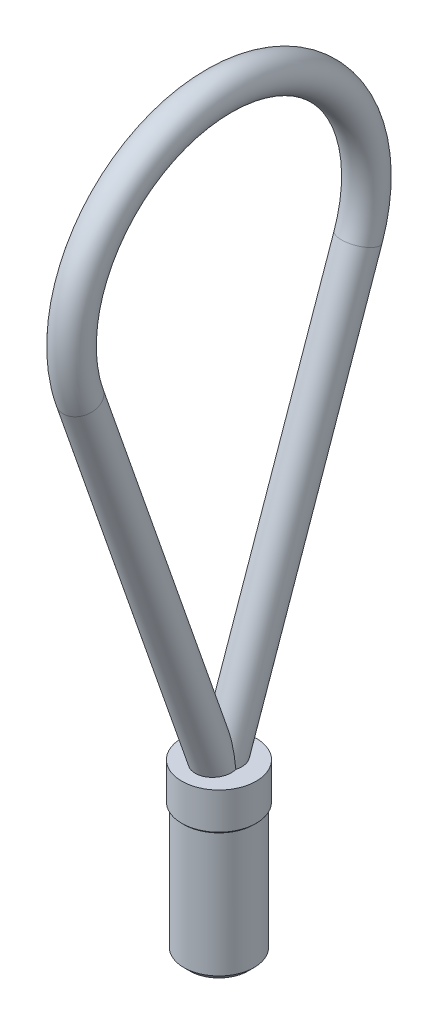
ISO-10303-21;
HEADER;
FILE_DESCRIPTION(('STEP AP214'),'2;1');
FILE_NAME('part.step','',(''),(''),'','','');
FILE_SCHEMA(('AUTOMOTIVE_DESIGN { 1 0 10303 214 1 1 1 1 }'));
ENDSEC;
DATA;
#1=APPLICATION_CONTEXT('core data for automotive mechanical design processes');
#2=APPLICATION_PROTOCOL_DEFINITION('international standard','automotive_design',2000,#1);
#3=PRODUCT_CONTEXT('',#1,'mechanical');
#4=PRODUCT('Part','Part','',(#3));
#5=PRODUCT_RELATED_PRODUCT_CATEGORY('part','',(#4));
#6=PRODUCT_DEFINITION_FORMATION('','',#4);
#7=PRODUCT_DEFINITION_CONTEXT('part definition',#1,'design');
#8=PRODUCT_DEFINITION('design','',#6,#7);
#9=PRODUCT_DEFINITION_SHAPE('','',#8);
#10=(LENGTH_UNIT() NAMED_UNIT(*) SI_UNIT(.MILLI.,.METRE.));
#11=(NAMED_UNIT(*) PLANE_ANGLE_UNIT() SI_UNIT($,.RADIAN.));
#12=(NAMED_UNIT(*) SI_UNIT($,.STERADIAN.) SOLID_ANGLE_UNIT());
#13=UNCERTAINTY_MEASURE_WITH_UNIT(LENGTH_MEASURE(1.E-05),#10,'distance_accuracy_value','');
#14=(GEOMETRIC_REPRESENTATION_CONTEXT(3) GLOBAL_UNCERTAINTY_ASSIGNED_CONTEXT((#13)) GLOBAL_UNIT_ASSIGNED_CONTEXT((#10,
#11,#12)) REPRESENTATION_CONTEXT('',''));
#15=CARTESIAN_POINT('',(0.,0.,0.));
#16=DIRECTION('',(0.,0.,1.));
#17=DIRECTION('',(1.,0.,0.));
#18=AXIS2_PLACEMENT_3D('',#15,#16,#17);
#19=CARTESIAN_POINT('',(0.,207.60000031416,17.9999963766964));
#20=DIRECTION('',(0.,1.,-1.74532925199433E-08));
#21=DIRECTION('',(0.,1.74532925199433E-08,1.));
#22=AXIS2_PLACEMENT_3D('',#19,#20,#21);
#23=PLANE('',#22);
#24=CARTESIAN_POINT('',(0.,207.60000031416,17.9999963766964));
#25=DIRECTION('',(0.,1.,-1.74532925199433E-08));
#26=DIRECTION('',(0.,1.74532925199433E-08,1.));
#27=AXIS2_PLACEMENT_3D('',#24,#25,#26);
#28=CIRCLE('',#27,8.48);
#29=CARTESIAN_POINT('',(0.,207.600000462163,26.4799963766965));
#30=VERTEX_POINT('',#29);
#31=EDGE_CURVE('E11',#30,#30,#28,.T.);
#32=ORIENTED_EDGE('',*,*,#31,.T.);
#33=EDGE_LOOP('',(#32));
#34=FACE_BOUND('',#33,.T.);
#35=CARTESIAN_POINT('',(0.,207.600000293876,16.8378663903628));
#36=DIRECTION('',(0.,1.,-1.74532925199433E-08));
#37=DIRECTION('',(0.,-1.74532925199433E-08,-1.));
#38=AXIS2_PLACEMENT_3D('',#35,#36,#37);
#39=ELLIPSE('',#38,4.23787001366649,4.);
#40=CARTESIAN_POINT('',(3.84666221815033,207.60000031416,17.9999963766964));
#41=VERTEX_POINT('',#40);
#42=CARTESIAN_POINT('',(-3.84666221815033,207.60000031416,17.9999963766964));
#43=VERTEX_POINT('',#42);
#44=EDGE_CURVE('E37',#41,#43,#39,.T.);
#45=ORIENTED_EDGE('',*,*,#44,.F.);
#46=CARTESIAN_POINT('',(0.,207.600000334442,19.1621263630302));
#47=DIRECTION('',(0.,-1.,1.74532925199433E-08));
#48=DIRECTION('',(0.,1.74532925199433E-08,1.));
#49=AXIS2_PLACEMENT_3D('',#46,#47,#48);
#50=ELLIPSE('',#49,4.23787001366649,4.);
#51=EDGE_CURVE('E26',#41,#43,#50,.T.);
#52=ORIENTED_EDGE('',*,*,#51,.T.);
#53=EDGE_LOOP('',(#45,#52));
#54=FACE_BOUND('',#53,.T.);
#55=ADVANCED_FACE('F17',(#34,#54),#23,.T.);
#56=CARTESIAN_POINT('',(0.,167.28000031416,17.9999970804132));
#57=DIRECTION('',(0.,1.,-1.74532925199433E-08));
#58=DIRECTION('',(0.,1.74532925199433E-08,1.));
#59=AXIS2_PLACEMENT_3D('',#56,#57,#58);
#60=CYLINDRICAL_SURFACE('',#59,8.48);
#61=CARTESIAN_POINT('',(0.,199.28000031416,17.9999965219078));
#62=DIRECTION('',(0.,1.,-1.74532925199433E-08));
#63=DIRECTION('',(0.,1.74532925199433E-08,1.));
#64=AXIS2_PLACEMENT_3D('',#61,#62,#63);
#65=CIRCLE('',#64,8.48);
#66=CARTESIAN_POINT('',(0.,199.280000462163,26.4799965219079));
#67=VERTEX_POINT('',#66);
#68=EDGE_CURVE('E61',#67,#67,#65,.T.);
#69=ORIENTED_EDGE('',*,*,#68,.T.);
#70=EDGE_LOOP('',(#69));
#71=FACE_BOUND('',#70,.T.);
#72=ORIENTED_EDGE('',*,*,#31,.F.);
#73=EDGE_LOOP('',(#72));
#74=FACE_BOUND('',#73,.T.);
#75=ADVANCED_FACE('F102',(#71,#74),#60,.T.);
#76=CARTESIAN_POINT('',(0.,199.040000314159,17.9999965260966));
#77=DIRECTION('',(0.,1.,-1.74532925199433E-08));
#78=DIRECTION('',(0.,1.74532925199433E-08,1.));
#79=AXIS2_PLACEMENT_3D('',#76,#77,#78);
#80=CONICAL_SURFACE('',#79,8.24,0.785398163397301);
#81=ORIENTED_EDGE('',*,*,#68,.F.);
#82=EDGE_LOOP('',(#81));
#83=FACE_BOUND('',#82,.T.);
#84=CARTESIAN_POINT('',(0.,198.800000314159,17.9999965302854));
#85=DIRECTION('',(0.,-1.,1.74532925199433E-08));
#86=DIRECTION('',(0.,1.74532925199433E-08,1.));
#87=AXIS2_PLACEMENT_3D('',#84,#85,#86);
#88=CIRCLE('',#87,8.);
#89=CARTESIAN_POINT('',(0.,198.800000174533,9.99999653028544));
#90=VERTEX_POINT('',#89);
#91=EDGE_CURVE('E56',#90,#90,#88,.T.);
#92=ORIENTED_EDGE('',*,*,#91,.F.);
#93=EDGE_LOOP('',(#92));
#94=FACE_BOUND('',#93,.T.);
#95=ADVANCED_FACE('F62',(#83,#94),#80,.T.);
#96=CARTESIAN_POINT('',(0.,167.28000031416,17.9999970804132));
#97=DIRECTION('',(0.,1.,-1.74532925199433E-08));
#98=DIRECTION('',(0.,1.74532925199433E-08,1.));
#99=AXIS2_PLACEMENT_3D('',#96,#97,#98);
#100=CYLINDRICAL_SURFACE('',#99,8.);
#101=CARTESIAN_POINT('',(0.,170.560500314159,17.9999970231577));
#102=DIRECTION('',(0.,1.,-1.74532925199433E-08));
#103=DIRECTION('',(0.,1.74532925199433E-08,1.));
#104=AXIS2_PLACEMENT_3D('',#101,#102,#103);
#105=CIRCLE('',#104,8.);
#106=CARTESIAN_POINT('',(0.,170.560500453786,25.9999970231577));
#107=VERTEX_POINT('',#106);
#108=EDGE_CURVE('E64',#107,#107,#105,.T.);
#109=ORIENTED_EDGE('',*,*,#108,.T.);
#110=EDGE_LOOP('',(#109));
#111=FACE_BOUND('',#110,.T.);
#112=ORIENTED_EDGE('',*,*,#91,.T.);
#113=EDGE_LOOP('',(#112));
#114=FACE_BOUND('',#113,.T.);
#115=ADVANCED_FACE('F110',(#111,#114),#100,.T.);
#116=CARTESIAN_POINT('',(0.,169.880250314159,17.9999970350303));
#117=DIRECTION('',(0.,1.,-1.74532925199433E-08));
#118=DIRECTION('',(0.,1.74532925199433E-08,1.));
#119=AXIS2_PLACEMENT_3D('',#116,#117,#118);
#120=CONICAL_SURFACE('',#119,7.31975,0.785398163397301);
#121=ORIENTED_EDGE('',*,*,#108,.F.);
#122=EDGE_LOOP('',(#121));
#123=FACE_BOUND('',#122,.T.);
#124=CARTESIAN_POINT('',(0.,169.200000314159,17.9999970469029));
#125=DIRECTION('',(0.,-1.,1.74532925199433E-08));
#126=DIRECTION('',(0.,1.74532925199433E-08,1.));
#127=AXIS2_PLACEMENT_3D('',#124,#125,#126);
#128=CIRCLE('',#127,6.6395000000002);
#129=CARTESIAN_POINT('',(0.,169.200000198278,11.3604970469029));
#130=VERTEX_POINT('',#129);
#131=EDGE_CURVE('E71',#130,#130,#128,.T.);
#132=ORIENTED_EDGE('',*,*,#131,.F.);
#133=EDGE_LOOP('',(#132));
#134=FACE_BOUND('',#133,.T.);
#135=ADVANCED_FACE('F112',(#123,#134),#120,.T.);
#136=CARTESIAN_POINT('',(0.,169.200000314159,17.9999970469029));
#137=DIRECTION('',(0.,1.,-1.74532925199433E-08));
#138=DIRECTION('',(0.,1.74532925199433E-08,1.));
#139=AXIS2_PLACEMENT_3D('',#136,#137,#138);
#140=PLANE('',#139);
#141=ORIENTED_EDGE('',*,*,#131,.T.);
#142=EDGE_LOOP('',(#141));
#143=FACE_BOUND('',#142,.T.);
#144=ADVANCED_FACE('F19',(#143),#140,.F.);
#145=CARTESIAN_POINT('',(0.,203.600000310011,17.7622899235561));
#146=DIRECTION('',(0.,-0.943870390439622,-0.330316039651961));
#147=DIRECTION('',(0.,-0.330316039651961,0.943870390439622));
#148=AXIS2_PLACEMENT_3D('',#145,#146,#147);
#149=CYLINDRICAL_SURFACE('',#148,4.);
#150=CARTESIAN_POINT('',(0.,204.279241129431,17.9999964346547));
#151=DIRECTION('',(0.,1.74532924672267E-08,1.));
#152=DIRECTION('',(0.,-1.,1.74532924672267E-08));
#153=AXIS2_PLACEMENT_3D('',#150,#151,#152);
#154=ELLIPSE('',#153,12.1096141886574,4.);
#155=EDGE_CURVE('E73',#41,#43,#154,.T.);
#156=ORIENTED_EDGE('',*,*,#155,.T.);
#157=ORIENTED_EDGE('',*,*,#51,.F.);
#158=EDGE_LOOP('',(#156,#157));
#159=FACE_BOUND('',#158,.T.);
#160=CARTESIAN_POINT('',(0.,294.901381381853,49.7140397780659));
#161=DIRECTION('',(0.,-0.943870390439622,-0.33031603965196));
#162=DIRECTION('',(0.,-0.33031603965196,0.943870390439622));
#163=AXIS2_PLACEMENT_3D('',#160,#161,#162);
#164=CIRCLE('',#163,4.);
#165=CARTESIAN_POINT('',(0.,296.222645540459,45.9385582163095));
#166=VERTEX_POINT('',#165);
#167=EDGE_CURVE('E21',#166,#166,#164,.T.);
#168=ORIENTED_EDGE('',*,*,#167,.T.);
#169=EDGE_LOOP('',(#168));
#170=FACE_BOUND('',#169,.T.);
#171=ADVANCED_FACE('F88',(#159,#170),#149,.T.);
#172=CARTESIAN_POINT('',(0.,203.600000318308,18.2377029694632));
#173=DIRECTION('',(0.,0.943870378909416,-0.330316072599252));
#174=DIRECTION('',(0.,-0.330316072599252,-0.943870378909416));
#175=AXIS2_PLACEMENT_3D('',#172,#173,#174);
#176=CYLINDRICAL_SURFACE('',#175,4.);
#177=ORIENTED_EDGE('',*,*,#44,.T.);
#178=ORIENTED_EDGE('',*,*,#155,.F.);
#179=EDGE_LOOP('',(#177,#178));
#180=FACE_BOUND('',#179,.T.);
#181=CARTESIAN_POINT('',(0.,294.901380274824,-13.7140500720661));
#182=DIRECTION('',(0.,0.943870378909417,-0.330316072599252));
#183=DIRECTION('',(0.,-0.330316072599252,-0.943870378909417));
#184=AXIS2_PLACEMENT_3D('',#181,#182,#183);
#185=CIRCLE('',#184,4.);
#186=CARTESIAN_POINT('',(0.,293.58011598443,-17.4895315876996));
#187=VERTEX_POINT('',#186);
#188=EDGE_CURVE('E82',#187,#187,#185,.T.);
#189=ORIENTED_EDGE('',*,*,#188,.F.);
#190=EDGE_LOOP('',(#189));
#191=FACE_BOUND('',#190,.T.);
#192=ADVANCED_FACE('F86',(#180,#191),#176,.T.);
#193=CARTESIAN_POINT('',(0.,306.000000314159,17.9999946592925));
#194=DIRECTION('',(1.,0.,0.));
#195=DIRECTION('',(0.,0.330316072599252,0.943870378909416));
#196=AXIS2_PLACEMENT_3D('',#193,#194,#195);
#197=TOROIDAL_SURFACE('',#196,33.6,4.);
#198=ORIENTED_EDGE('',*,*,#188,.T.);
#199=EDGE_LOOP('',(#198));
#200=FACE_BOUND('',#199,.T.);
#201=ORIENTED_EDGE('',*,*,#167,.F.);
#202=EDGE_LOOP('',(#201));
#203=FACE_BOUND('',#202,.T.);
#204=ADVANCED_FACE('F93',(#200,#203),#197,.T.);
#205=CLOSED_SHELL('',(#55,#75,#95,#115,#135,#144,#171,#192,#204));
#206=MANIFOLD_SOLID_BREP('B1',#205);
#207=ADVANCED_BREP_SHAPE_REPRESENTATION('',(#18,#206),#14);
#208=SHAPE_DEFINITION_REPRESENTATION(#9,#207);
ENDSEC;
END-ISO-10303-21;
